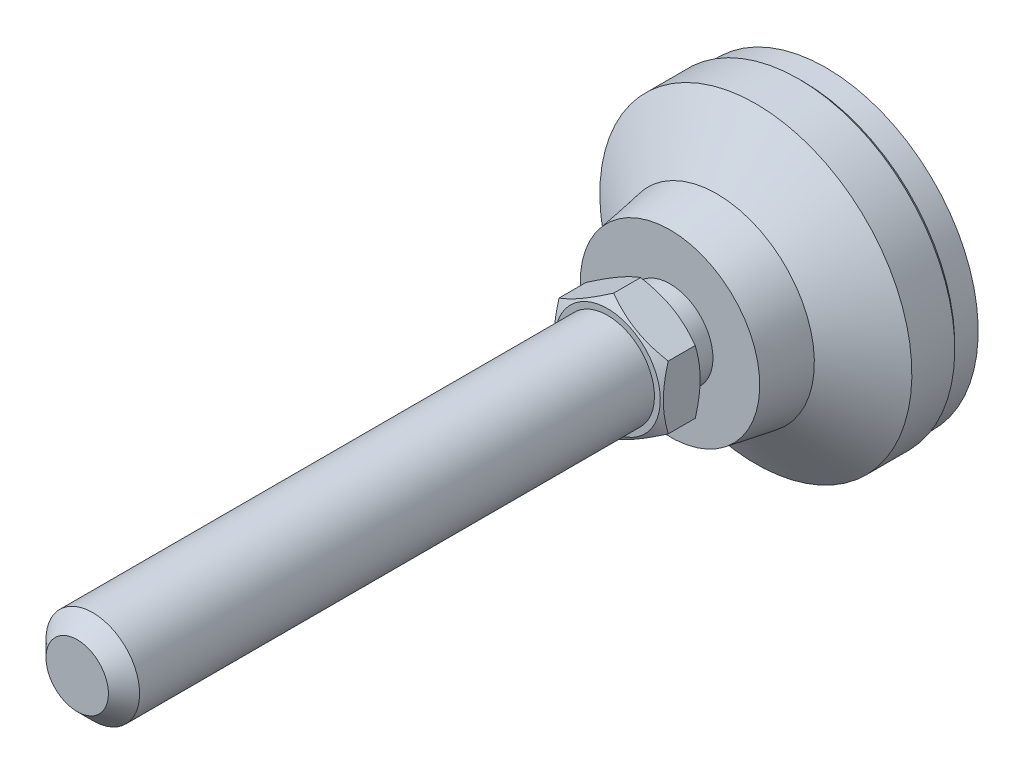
ISO-10303-21;
HEADER;
FILE_DESCRIPTION(('STEP AP214'),'2;1');
FILE_NAME('part.step','',(''),(''),'','','');
FILE_SCHEMA(('AUTOMOTIVE_DESIGN { 1 0 10303 214 1 1 1 1 }'));
ENDSEC;
DATA;
#1=APPLICATION_CONTEXT('core data for automotive mechanical design processes');
#2=APPLICATION_PROTOCOL_DEFINITION('international standard','automotive_design',2000,#1);
#3=PRODUCT_CONTEXT('',#1,'mechanical');
#4=PRODUCT('Part','Part','',(#3));
#5=PRODUCT_RELATED_PRODUCT_CATEGORY('part','',(#4));
#6=PRODUCT_DEFINITION_FORMATION('','',#4);
#7=PRODUCT_DEFINITION_CONTEXT('part definition',#1,'design');
#8=PRODUCT_DEFINITION('design','',#6,#7);
#9=PRODUCT_DEFINITION_SHAPE('','',#8);
#10=(LENGTH_UNIT() NAMED_UNIT(*) SI_UNIT(.MILLI.,.METRE.));
#11=(NAMED_UNIT(*) PLANE_ANGLE_UNIT() SI_UNIT($,.RADIAN.));
#12=(NAMED_UNIT(*) SI_UNIT($,.STERADIAN.) SOLID_ANGLE_UNIT());
#13=UNCERTAINTY_MEASURE_WITH_UNIT(LENGTH_MEASURE(1.E-05),#10,'distance_accuracy_value','');
#14=(GEOMETRIC_REPRESENTATION_CONTEXT(3) GLOBAL_UNCERTAINTY_ASSIGNED_CONTEXT((#13)) GLOBAL_UNIT_ASSIGNED_CONTEXT((#10,
#11,#12)) REPRESENTATION_CONTEXT('',''));
#15=CARTESIAN_POINT('',(0.,0.,0.));
#16=DIRECTION('',(0.,0.,1.));
#17=DIRECTION('',(1.,0.,0.));
#18=AXIS2_PLACEMENT_3D('',#15,#16,#17);
#19=CARTESIAN_POINT('',(0.,0.,1.99999999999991));
#20=DIRECTION('',(0.,0.,-1.));
#21=DIRECTION('',(0.,1.,0.));
#22=AXIS2_PLACEMENT_3D('',#19,#20,#21);
#23=CYLINDRICAL_SURFACE('',#22,20.);
#24=CARTESIAN_POINT('',(0.,0.,3.5));
#25=DIRECTION('',(0.,0.,-1.));
#26=DIRECTION('',(0.,1.,0.));
#27=AXIS2_PLACEMENT_3D('',#24,#25,#26);
#28=CIRCLE('',#27,20.);
#29=CARTESIAN_POINT('',(0.,20.,3.5));
#30=VERTEX_POINT('',#29);
#31=EDGE_CURVE('E114',#30,#30,#28,.F.);
#32=ORIENTED_EDGE('',*,*,#31,.T.);
#33=EDGE_LOOP('',(#32));
#34=FACE_BOUND('',#33,.T.);
#35=CARTESIAN_POINT('',(0.,0.,9.));
#36=DIRECTION('',(0.,0.,-1.));
#37=DIRECTION('',(0.,1.,0.));
#38=AXIS2_PLACEMENT_3D('',#35,#36,#37);
#39=CIRCLE('',#38,20.);
#40=CARTESIAN_POINT('',(0.,20.,9.));
#41=VERTEX_POINT('',#40);
#42=EDGE_CURVE('E108',#41,#41,#39,.T.);
#43=ORIENTED_EDGE('',*,*,#42,.T.);
#44=EDGE_LOOP('',(#43));
#45=FACE_BOUND('',#44,.T.);
#46=ADVANCED_FACE('F14',(#34,#45),#23,.T.);
#47=CARTESIAN_POINT('',(0.,0.,14.));
#48=DIRECTION('',(0.,0.,-1.));
#49=DIRECTION('',(0.,1.,0.));
#50=AXIS2_PLACEMENT_3D('',#47,#48,#49);
#51=CONICAL_SURFACE('',#50,12.5,0.98279372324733);
#52=ORIENTED_EDGE('',*,*,#42,.F.);
#53=EDGE_LOOP('',(#52));
#54=FACE_BOUND('',#53,.T.);
#55=CARTESIAN_POINT('',(0.,0.,14.));
#56=DIRECTION('',(0.,0.,-1.));
#57=DIRECTION('',(0.,1.,0.));
#58=AXIS2_PLACEMENT_3D('',#55,#56,#57);
#59=CIRCLE('',#58,12.5);
#60=CARTESIAN_POINT('',(0.,12.5,14.));
#61=VERTEX_POINT('',#60);
#62=EDGE_CURVE('E105',#61,#61,#59,.T.);
#63=ORIENTED_EDGE('',*,*,#62,.T.);
#64=EDGE_LOOP('',(#63));
#65=FACE_BOUND('',#64,.T.);
#66=ADVANCED_FACE('F226',(#54,#65),#51,.T.);
#67=CARTESIAN_POINT('',(0.,0.,20.));
#68=DIRECTION('',(0.,0.,-1.));
#69=DIRECTION('',(0.,1.,0.));
#70=AXIS2_PLACEMENT_3D('',#67,#68,#69);
#71=CONICAL_SURFACE('',#70,11.5,0.165148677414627);
#72=ORIENTED_EDGE('',*,*,#62,.F.);
#73=EDGE_LOOP('',(#72));
#74=FACE_BOUND('',#73,.T.);
#75=CARTESIAN_POINT('',(0.,0.,20.));
#76=DIRECTION('',(0.,0.,-1.));
#77=DIRECTION('',(0.,1.,0.));
#78=AXIS2_PLACEMENT_3D('',#75,#76,#77);
#79=CIRCLE('',#78,11.5);
#80=CARTESIAN_POINT('',(0.,11.5,20.));
#81=VERTEX_POINT('',#80);
#82=EDGE_CURVE('E102',#81,#81,#79,.T.);
#83=ORIENTED_EDGE('',*,*,#82,.T.);
#84=EDGE_LOOP('',(#83));
#85=FACE_BOUND('',#84,.T.);
#86=ADVANCED_FACE('F222',(#74,#85),#71,.T.);
#87=CARTESIAN_POINT('',(-11.5,0.,20.));
#88=DIRECTION('',(0.,0.,-1.));
#89=DIRECTION('',(0.,1.,0.));
#90=AXIS2_PLACEMENT_3D('',#87,#88,#89);
#91=PLANE('',#90);
#92=ORIENTED_EDGE('',*,*,#82,.F.);
#93=EDGE_LOOP('',(#92));
#94=FACE_BOUND('',#93,.T.);
#95=CARTESIAN_POINT('',(0.,0.,20.));
#96=DIRECTION('',(0.,0.,-1.));
#97=DIRECTION('',(0.,1.,0.));
#98=AXIS2_PLACEMENT_3D('',#95,#96,#97);
#99=CIRCLE('',#98,5.49999999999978);
#100=CARTESIAN_POINT('',(0.,5.49999999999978,20.));
#101=VERTEX_POINT('',#100);
#102=EDGE_CURVE('E99',#101,#101,#99,.T.);
#103=ORIENTED_EDGE('',*,*,#102,.T.);
#104=EDGE_LOOP('',(#103));
#105=FACE_BOUND('',#104,.T.);
#106=ADVANCED_FACE('F218',(#94,#105),#91,.F.);
#107=CARTESIAN_POINT('',(0.,0.,1.99999999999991));
#108=DIRECTION('',(0.,0.,-1.));
#109=DIRECTION('',(0.,1.,0.));
#110=AXIS2_PLACEMENT_3D('',#107,#108,#109);
#111=CYLINDRICAL_SURFACE('',#110,5.49999999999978);
#112=ORIENTED_EDGE('',*,*,#102,.F.);
#113=EDGE_LOOP('',(#112));
#114=FACE_BOUND('',#113,.T.);
#115=CARTESIAN_POINT('',(0.,0.,23.));
#116=DIRECTION('',(0.,0.,-1.));
#117=DIRECTION('',(0.,1.,0.));
#118=AXIS2_PLACEMENT_3D('',#115,#116,#117);
#119=CIRCLE('',#118,5.49999999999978);
#120=CARTESIAN_POINT('',(0.,5.49999999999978,23.));
#121=VERTEX_POINT('',#120);
#122=EDGE_CURVE('E96',#121,#121,#119,.T.);
#123=ORIENTED_EDGE('',*,*,#122,.T.);
#124=EDGE_LOOP('',(#123));
#125=FACE_BOUND('',#124,.T.);
#126=ADVANCED_FACE('F214',(#114,#125),#111,.T.);
#127=CARTESIAN_POINT('',(-5.49999999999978,0.,23.));
#128=DIRECTION('',(0.,0.,1.));
#129=DIRECTION('',(0.,-1.,0.));
#130=AXIS2_PLACEMENT_3D('',#127,#128,#129);
#131=PLANE('',#130);
#132=CARTESIAN_POINT('',(0.,0.,23.));
#133=DIRECTION('',(0.,0.,1.));
#134=DIRECTION('',(0.,-1.,0.));
#135=AXIS2_PLACEMENT_3D('',#132,#133,#134);
#136=CIRCLE('',#135,6.75);
#137=CARTESIAN_POINT('',(0.,-6.75,23.));
#138=VERTEX_POINT('',#137);
#139=EDGE_CURVE('E305',#138,#138,#136,.T.);
#140=ORIENTED_EDGE('',*,*,#139,.F.);
#141=EDGE_LOOP('',(#140));
#142=FACE_BOUND('',#141,.T.);
#143=ORIENTED_EDGE('',*,*,#122,.F.);
#144=EDGE_LOOP('',(#143));
#145=FACE_BOUND('',#144,.T.);
#146=ADVANCED_FACE('F211',(#142,#145),#131,.F.);
#147=CARTESIAN_POINT('',(0.,0.,3.));
#148=DIRECTION('',(0.,0.,1.));
#149=DIRECTION('',(0.,-1.,0.));
#150=AXIS2_PLACEMENT_3D('',#147,#148,#149);
#151=CONICAL_SURFACE('',#150,19.5,0.785398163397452);
#152=ORIENTED_EDGE('',*,*,#31,.F.);
#153=EDGE_LOOP('',(#152));
#154=FACE_BOUND('',#153,.T.);
#155=CARTESIAN_POINT('',(0.,0.,3.));
#156=DIRECTION('',(0.,0.,-1.));
#157=DIRECTION('',(0.,1.,0.));
#158=AXIS2_PLACEMENT_3D('',#155,#156,#157);
#159=CIRCLE('',#158,19.5);
#160=CARTESIAN_POINT('',(0.,19.5,3.));
#161=VERTEX_POINT('',#160);
#162=EDGE_CURVE('E111',#161,#161,#159,.T.);
#163=ORIENTED_EDGE('',*,*,#162,.F.);
#164=EDGE_LOOP('',(#163));
#165=FACE_BOUND('',#164,.T.);
#166=ADVANCED_FACE('F16',(#154,#165),#151,.T.);
#167=CARTESIAN_POINT('',(0.,0.,0.));
#168=DIRECTION('',(0.,0.,1.));
#169=DIRECTION('',(0.,-1.,0.));
#170=AXIS2_PLACEMENT_3D('',#167,#168,#169);
#171=CYLINDRICAL_SURFACE('',#170,19.5);
#172=CARTESIAN_POINT('',(0.,0.,0.));
#173=DIRECTION('',(0.,0.,-1.));
#174=DIRECTION('',(0.,1.,0.));
#175=AXIS2_PLACEMENT_3D('',#172,#173,#174);
#176=CIRCLE('',#175,19.5);
#177=CARTESIAN_POINT('',(0.,19.5,0.));
#178=VERTEX_POINT('',#177);
#179=EDGE_CURVE('E278',#178,#178,#176,.T.);
#180=ORIENTED_EDGE('',*,*,#179,.F.);
#181=EDGE_LOOP('',(#180));
#182=FACE_BOUND('',#181,.T.);
#183=ORIENTED_EDGE('',*,*,#162,.T.);
#184=EDGE_LOOP('',(#183));
#185=FACE_BOUND('',#184,.T.);
#186=ADVANCED_FACE('F251',(#182,#185),#171,.T.);
#187=CARTESIAN_POINT('',(0.,0.,0.));
#188=DIRECTION('',(0.,0.,-1.));
#189=DIRECTION('',(0.,1.,0.));
#190=AXIS2_PLACEMENT_3D('',#187,#188,#189);
#191=PLANE('',#190);
#192=ORIENTED_EDGE('',*,*,#179,.T.);
#193=EDGE_LOOP('',(#192));
#194=FACE_BOUND('',#193,.T.);
#195=ADVANCED_FACE('F134',(#194),#191,.T.);
#196=CARTESIAN_POINT('',(0.,0.,23.));
#197=DIRECTION('',(0.,0.,1.));
#198=DIRECTION('',(0.,-1.,0.));
#199=AXIS2_PLACEMENT_3D('',#196,#197,#198);
#200=CONICAL_SURFACE('',#199,6.75,1.0471975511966);
#201=CARTESIAN_POINT('',(0.000200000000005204,-8.08301923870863,23.7696190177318));
#202=CARTESIAN_POINT('',(-0.153667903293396,-7.99418356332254,23.7183374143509));
#203=CARTESIAN_POINT('',(-0.308109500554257,-7.90501666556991,23.669383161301));
#204=CARTESIAN_POINT('',(-0.618246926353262,-7.72595873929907,23.5767703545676));
#205=CARTESIAN_POINT('',(-0.773943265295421,-7.63606741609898,23.5331140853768));
#206=CARTESIAN_POINT('',(-1.24352516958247,-7.36495417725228,23.4109491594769));
#207=CARTESIAN_POINT('',(-1.55926433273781,-7.18266208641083,23.3414631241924));
#208=CARTESIAN_POINT('',(-2.03176224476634,-6.90986528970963,23.2599825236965));
#209=CARTESIAN_POINT('',(-2.18710922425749,-6.82017566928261,23.2367710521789));
#210=CARTESIAN_POINT('',(-2.49850511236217,-6.64039116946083,23.1978487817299));
#211=CARTESIAN_POINT('',(-2.65455395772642,-6.55029632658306,23.1821373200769));
#212=CARTESIAN_POINT('',(-2.96692267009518,-6.36995016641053,23.1586154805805));
#213=CARTESIAN_POINT('',(-3.12324202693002,-6.27969914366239,23.1507961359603));
#214=CARTESIAN_POINT('',(-3.43601650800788,-6.09911871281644,23.1432178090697));
#215=CARTESIAN_POINT('',(-3.59247162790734,-6.00878930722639,23.1434585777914));
#216=CARTESIAN_POINT('',(-4.02110687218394,-5.76131663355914,23.1551972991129));
#217=CARTESIAN_POINT('',(-4.2931466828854,-5.60425437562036,23.1749033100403));
#218=CARTESIAN_POINT('',(-4.83541944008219,-5.29117305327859,23.2373910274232));
#219=CARTESIAN_POINT('',(-5.10565047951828,-5.13515508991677,23.2801940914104));
#220=CARTESIAN_POINT('',(-5.64901454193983,-4.82144370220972,23.3871892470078));
#221=CARTESIAN_POINT('',(-5.92207900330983,-4.66378986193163,23.4518346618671));
#222=CARTESIAN_POINT('',(-6.46413578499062,-4.35083323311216,23.5985536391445));
#223=CARTESIAN_POINT('',(-6.73313504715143,-4.19552643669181,23.680592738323));
#224=CARTESIAN_POINT('',(-7.0002,-4.04133641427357,23.7696190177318));
#225=B_SPLINE_CURVE_WITH_KNOTS('',3,(#201,#202,#203,#204,#205,#206,#207,#208,#209,#210,#211,
#212,#213,#214,#215,#216,#217,#218,#219,#220,#221,#222,#223,#224),.UNSPECIFIED.,.F.,.F.,(4,2,2,
2,2,2,2,2,2,2,2,4),(0.,0.554727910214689,1.10969417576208,2.22193274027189,2.76443041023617,
3.30688013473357,3.84871284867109,4.39052882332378,5.33376515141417,6.27787517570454,
7.24292418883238,8.20607866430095),.UNSPECIFIED.);
#226=CARTESIAN_POINT('',(0.,-8.08290376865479,23.7695523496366));
#227=VERTEX_POINT('',#226);
#228=CARTESIAN_POINT('',(-7.,-4.04145188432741,23.7695523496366));
#229=VERTEX_POINT('',#228);
#230=EDGE_CURVE('E73',#227,#229,#225,.T.);
#231=ORIENTED_EDGE('',*,*,#230,.T.);
#232=CARTESIAN_POINT('',(-7.,10.7756723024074,26.5216707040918));
#233=CARTESIAN_POINT('',(-7.,10.470597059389,26.3740060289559));
#234=CARTESIAN_POINT('',(-7.,10.1648128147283,26.2277806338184));
#235=CARTESIAN_POINT('',(-7.,9.55144894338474,25.939019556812));
#236=CARTESIAN_POINT('',(-7.,9.24386903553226,25.7964844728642));
#237=CARTESIAN_POINT('',(-7.,8.62491290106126,25.5151808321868));
#238=CARTESIAN_POINT('',(-7.,8.31352506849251,25.3764377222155));
#239=CARTESIAN_POINT('',(-7.,7.68824450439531,25.1047376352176));
#240=CARTESIAN_POINT('',(-7.,7.3743518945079,24.9717803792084));
#241=CARTESIAN_POINT('',(-7.,6.73374949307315,24.7091594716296));
#242=CARTESIAN_POINT('',(-7.,6.40694455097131,24.5797266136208));
#243=CARTESIAN_POINT('',(-7.,5.74948257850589,24.3308524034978));
#244=CARTESIAN_POINT('',(-7.,5.41882511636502,24.2114121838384));
#245=CARTESIAN_POINT('',(-7.,4.75377330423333,23.9857180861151));
#246=CARTESIAN_POINT('',(-7.,4.41938835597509,23.8794368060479));
#247=CARTESIAN_POINT('',(-7.,3.74583525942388,23.6835221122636));
#248=CARTESIAN_POINT('',(-7.,3.40666867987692,23.5938833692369));
#249=CARTESIAN_POINT('',(-7.,2.72516710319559,23.4360858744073));
#250=CARTESIAN_POINT('',(-7.,2.38285906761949,23.3678138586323));
#251=CARTESIAN_POINT('',(-7.,1.86634504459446,23.2844268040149));
#252=CARTESIAN_POINT('',(-7.,1.69365173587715,23.2598001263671));
#253=CARTESIAN_POINT('',(-7.,1.34743429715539,23.2173718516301));
#254=CARTESIAN_POINT('',(-7.,1.17391024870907,23.1995695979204));
#255=CARTESIAN_POINT('',(-7.,0.828495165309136,23.1713639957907));
#256=CARTESIAN_POINT('',(-7.,0.656611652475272,23.1608688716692));
#257=CARTESIAN_POINT('',(-7.,0.312555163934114,23.1471508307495));
#258=CARTESIAN_POINT('',(-7.,0.140382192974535,23.1439277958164));
#259=CARTESIAN_POINT('',(-7.,-0.203946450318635,23.1448306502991));
#260=CARTESIAN_POINT('',(-7.,-0.376102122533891,23.1489565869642));
#261=CARTESIAN_POINT('',(-7.,-0.720089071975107,23.1644579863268));
#262=CARTESIAN_POINT('',(-7.,-0.891920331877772,23.1758338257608));
#263=CARTESIAN_POINT('',(-7.,-1.30734464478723,23.2118624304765));
#264=CARTESIAN_POINT('',(-7.,-1.55063381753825,23.2400915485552));
#265=CARTESIAN_POINT('',(-7.,-2.03534189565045,23.3095242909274));
#266=CARTESIAN_POINT('',(-7.,-2.27676053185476,23.3507297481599));
#267=CARTESIAN_POINT('',(-7.,-2.99797093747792,23.4916200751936));
#268=CARTESIAN_POINT('',(-7.,-3.47443457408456,23.6085512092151));
#269=CARTESIAN_POINT('',(-7.,-4.18677226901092,23.8105038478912));
#270=CARTESIAN_POINT('',(-7.,-4.42636136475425,23.883168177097));
#271=CARTESIAN_POINT('',(-7.,-4.90321122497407,24.0358402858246));
#272=CARTESIAN_POINT('',(-7.,-5.14047197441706,24.1158481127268));
#273=CARTESIAN_POINT('',(-7.,-5.61274376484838,24.281940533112));
#274=CARTESIAN_POINT('',(-7.,-5.84775556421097,24.3680229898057));
#275=CARTESIAN_POINT('',(-7.,-6.31584583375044,24.5452721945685));
#276=CARTESIAN_POINT('',(-7.,-6.54892432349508,24.6364388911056));
#277=CARTESIAN_POINT('',(-7.,-7.0859805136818,24.8521790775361));
#278=CARTESIAN_POINT('',(-7.,-7.38934113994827,24.9782855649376));
#279=CARTESIAN_POINT('',(-7.,-7.99359303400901,25.2362973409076));
#280=CARTESIAN_POINT('',(-7.,-8.29448417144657,25.3682029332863));
#281=CARTESIAN_POINT('',(-7.,-8.89424068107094,25.6366863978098));
#282=CARTESIAN_POINT('',(-7.,-9.19310564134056,25.7732651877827));
#283=CARTESIAN_POINT('',(-7.,-9.78907845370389,26.0501823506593));
#284=CARTESIAN_POINT('',(-7.,-10.0861863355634,26.1905206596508));
#285=CARTESIAN_POINT('',(-7.,-10.6792023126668,26.4744042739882));
#286=CARTESIAN_POINT('',(-7.,-10.9751090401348,26.6179524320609));
#287=CARTESIAN_POINT('',(-7.,-11.5656733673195,26.9075977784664));
#288=CARTESIAN_POINT('',(-7.,-11.8603309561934,27.0536949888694));
#289=CARTESIAN_POINT('',(-7.,-12.7427336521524,27.4951566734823));
#290=CARTESIAN_POINT('',(-7.,-13.3288964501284,27.7936852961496));
#291=CARTESIAN_POINT('',(-7.,-14.1823685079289,28.2338804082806));
#292=CARTESIAN_POINT('',(-7.,-14.4509033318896,28.3731855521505));
#293=CARTESIAN_POINT('',(-7.,-14.9873899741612,28.652903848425));
#294=CARTESIAN_POINT('',(-7.,-15.2553418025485,28.7933169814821));
#295=CARTESIAN_POINT('',(-7.,-16.0584600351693,29.2160063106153));
#296=CARTESIAN_POINT('',(-7.,-16.5928687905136,29.4997218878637));
#297=CARTESIAN_POINT('',(-7.,-17.6588858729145,30.0694348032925));
#298=CARTESIAN_POINT('',(-7.,-18.1904978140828,30.355425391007));
#299=CARTESIAN_POINT('',(-7.,-19.2524337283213,30.9297243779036));
#300=CARTESIAN_POINT('',(-7.,-19.782757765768,31.218032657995));
#301=CARTESIAN_POINT('',(-7.,-20.3126038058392,31.5072111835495));
#302=B_SPLINE_CURVE_WITH_KNOTS('',3,(#232,#233,#234,#235,#236,#237,#238,#239,#240,#241,#242,
#243,#244,#245,#246,#247,#248,#249,#250,#251,#252,#253,#254,#255,#256,#257,#258,#259,#260,#261,
#262,#263,#264,#265,#266,#267,#268,#269,#270,#271,#272,#273,#274,#275,#276,#277,#278,#279,#280,
#281,#282,#283,#284,#285,#286,#287,#288,#289,#290,#291,#292,#293,#294,#295,#296,#297,#298,#299,
#300,#301),.UNSPECIFIED.,.F.,.F.,(4,2,2,2,2,2,2,2,2,2,2,2,2,2,2,2,2,2,2,2,2,2,2,2,2,2,2,2,2,2,2,
2,2,2,4),(0.,1.01681261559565,2.03378896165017,3.05643842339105,4.07903852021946,
5.1334206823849,6.18792217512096,7.24018947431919,8.29211923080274,9.33837441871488,
9.86158193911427,10.3847391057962,10.9012008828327,11.417654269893,11.9341109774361,
12.4505945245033,13.1849421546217,13.9193935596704,15.3891445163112,16.1401820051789,
16.8912243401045,17.6420037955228,18.3927756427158,19.3782791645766,20.3638343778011,
21.3495842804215,22.3353174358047,23.3219645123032,24.3086201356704,26.2819721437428,
27.1895239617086,28.0970599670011,29.91220086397,31.7231661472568,33.5340389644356),.UNSPECIFIED.);
#303=CARTESIAN_POINT('',(-7.,4.04145188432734,23.7695523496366));
#304=VERTEX_POINT('',#303);
#305=EDGE_CURVE('E81',#229,#304,#302,.F.);
#306=ORIENTED_EDGE('',*,*,#305,.T.);
#307=CARTESIAN_POINT('',(-7.0002,4.0413364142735,23.7696190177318));
#308=CARTESIAN_POINT('',(-6.8463320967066,4.13017208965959,23.7183374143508));
#309=CARTESIAN_POINT('',(-6.69189049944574,4.21933898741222,23.669383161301));
#310=CARTESIAN_POINT('',(-6.38175307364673,4.39839691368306,23.5767703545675));
#311=CARTESIAN_POINT('',(-6.22605673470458,4.48828823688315,23.5331140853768));
#312=CARTESIAN_POINT('',(-5.75647483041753,4.75940147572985,23.4109491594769));
#313=CARTESIAN_POINT('',(-5.4407356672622,4.94169356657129,23.3414631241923));
#314=CARTESIAN_POINT('',(-4.96823775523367,5.2144903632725,23.2599825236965));
#315=CARTESIAN_POINT('',(-4.81289077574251,5.30417998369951,23.2367710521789));
#316=CARTESIAN_POINT('',(-4.50149488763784,5.48396448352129,23.1978487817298));
#317=CARTESIAN_POINT('',(-4.34544604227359,5.57405932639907,23.1821373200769));
#318=CARTESIAN_POINT('',(-4.03307732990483,5.75440548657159,23.1586154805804));
#319=CARTESIAN_POINT('',(-3.87675797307,5.84465650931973,23.1507961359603));
#320=CARTESIAN_POINT('',(-3.56398349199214,6.02523694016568,23.1432178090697));
#321=CARTESIAN_POINT('',(-3.40752837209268,6.11556634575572,23.1434585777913));
#322=CARTESIAN_POINT('',(-2.97889312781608,6.36303901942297,23.1551972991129));
#323=CARTESIAN_POINT('',(-2.70685331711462,6.52010127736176,23.1749033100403));
#324=CARTESIAN_POINT('',(-2.16458055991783,6.83318259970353,23.2373910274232));
#325=CARTESIAN_POINT('',(-1.89434952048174,6.98920056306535,23.2801940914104));
#326=CARTESIAN_POINT('',(-1.35098545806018,7.3029119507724,23.3871892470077));
#327=CARTESIAN_POINT('',(-1.07792099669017,7.4605657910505,23.4518346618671));
#328=CARTESIAN_POINT('',(-0.535864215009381,7.77352241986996,23.5985536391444));
#329=CARTESIAN_POINT('',(-0.266864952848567,7.92882921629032,23.6805927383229));
#330=CARTESIAN_POINT('',(0.000200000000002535,8.08301923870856,23.7696190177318));
#331=B_SPLINE_CURVE_WITH_KNOTS('',3,(#307,#308,#309,#310,#311,#312,#313,#314,#315,#316,#317,
#318,#319,#320,#321,#322,#323,#324,#325,#326,#327,#328,#329,#330),.UNSPECIFIED.,.F.,.F.,(4,2,2,
2,2,2,2,2,2,2,2,4),(0.,0.554727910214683,1.10969417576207,2.22193274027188,2.76443041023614,
3.30688013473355,3.84871284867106,4.39052882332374,5.33376515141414,6.27787517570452,
7.24292418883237,8.20607866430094),.UNSPECIFIED.);
#332=CARTESIAN_POINT('',(0.,8.08290376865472,23.7695523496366));
#333=VERTEX_POINT('',#332);
#334=EDGE_CURVE('E193',#304,#333,#331,.T.);
#335=ORIENTED_EDGE('',*,*,#334,.T.);
#336=CARTESIAN_POINT('',(-0.000199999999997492,8.08301923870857,23.7696190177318));
#337=CARTESIAN_POINT('',(0.153667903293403,7.99418356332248,23.7183374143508));
#338=CARTESIAN_POINT('',(0.308109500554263,7.90501666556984,23.669383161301));
#339=CARTESIAN_POINT('',(0.618246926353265,7.72595873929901,23.5767703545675));
#340=CARTESIAN_POINT('',(0.773943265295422,7.63606741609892,23.5331140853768));
#341=CARTESIAN_POINT('',(1.24352516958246,7.36495417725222,23.4109491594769));
#342=CARTESIAN_POINT('',(1.5592643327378,7.18266208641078,23.3414631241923));
#343=CARTESIAN_POINT('',(2.03176224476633,6.90986528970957,23.2599825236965));
#344=CARTESIAN_POINT('',(2.18710922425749,6.82017566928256,23.2367710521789));
#345=CARTESIAN_POINT('',(2.49850511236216,6.64039116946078,23.1978487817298));
#346=CARTESIAN_POINT('',(2.65455395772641,6.550296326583,23.1821373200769));
#347=CARTESIAN_POINT('',(2.96692267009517,6.36995016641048,23.1586154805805));
#348=CARTESIAN_POINT('',(3.12324202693,6.27969914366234,23.1507961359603));
#349=CARTESIAN_POINT('',(3.43601650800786,6.09911871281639,23.1432178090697));
#350=CARTESIAN_POINT('',(3.59247162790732,6.00878930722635,23.1434585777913));
#351=CARTESIAN_POINT('',(4.02110687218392,5.7613166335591,23.1551972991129));
#352=CARTESIAN_POINT('',(4.29314668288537,5.60425437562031,23.1749033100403));
#353=CARTESIAN_POINT('',(4.83541944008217,5.29117305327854,23.2373910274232));
#354=CARTESIAN_POINT('',(5.10565047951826,5.13515508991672,23.2801940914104));
#355=CARTESIAN_POINT('',(5.64901454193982,4.82144370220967,23.3871892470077));
#356=CARTESIAN_POINT('',(5.92207900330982,4.66378986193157,23.4518346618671));
#357=CARTESIAN_POINT('',(6.46413578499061,4.35083323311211,23.5985536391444));
#358=CARTESIAN_POINT('',(6.73313504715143,4.19552643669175,23.6805927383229));
#359=CARTESIAN_POINT('',(7.0002,4.04133641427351,23.7696190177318));
#360=B_SPLINE_CURVE_WITH_KNOTS('',3,(#336,#337,#338,#339,#340,#341,#342,#343,#344,#345,#346,
#347,#348,#349,#350,#351,#352,#353,#354,#355,#356,#357,#358,#359),.UNSPECIFIED.,.F.,.F.,(4,2,2,
2,2,2,2,2,2,2,2,4),(0.,0.554727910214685,1.10969417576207,2.22193274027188,2.76443041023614,
3.30688013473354,3.84871284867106,4.39052882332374,5.33376515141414,6.27787517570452,
7.24292418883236,8.20607866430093),.UNSPECIFIED.);
#361=CARTESIAN_POINT('',(7.,4.04145188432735,23.7695523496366));
#362=VERTEX_POINT('',#361);
#363=EDGE_CURVE('E304',#333,#362,#360,.T.);
#364=ORIENTED_EDGE('',*,*,#363,.T.);
#365=CARTESIAN_POINT('',(7.,10.7756723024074,26.5216707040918));
#366=CARTESIAN_POINT('',(7.,10.470597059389,26.3740060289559));
#367=CARTESIAN_POINT('',(7.,10.1648128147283,26.2277806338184));
#368=CARTESIAN_POINT('',(7.,9.55144894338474,25.939019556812));
#369=CARTESIAN_POINT('',(7.,9.24386903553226,25.7964844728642));
#370=CARTESIAN_POINT('',(7.,8.62491290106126,25.5151808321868));
#371=CARTESIAN_POINT('',(7.,8.31352506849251,25.3764377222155));
#372=CARTESIAN_POINT('',(7.,7.68824450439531,25.1047376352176));
#373=CARTESIAN_POINT('',(7.,7.3743518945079,24.9717803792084));
#374=CARTESIAN_POINT('',(7.,6.73374949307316,24.7091594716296));
#375=CARTESIAN_POINT('',(7.,6.40694455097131,24.5797266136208));
#376=CARTESIAN_POINT('',(7.,5.7494825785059,24.3308524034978));
#377=CARTESIAN_POINT('',(7.,5.41882511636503,24.2114121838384));
#378=CARTESIAN_POINT('',(7.,4.75377330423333,23.9857180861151));
#379=CARTESIAN_POINT('',(7.,4.41938835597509,23.8794368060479));
#380=CARTESIAN_POINT('',(7.,3.74583525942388,23.6835221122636));
#381=CARTESIAN_POINT('',(7.,3.40666867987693,23.5938833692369));
#382=CARTESIAN_POINT('',(7.,2.7251671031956,23.4360858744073));
#383=CARTESIAN_POINT('',(7.,2.3828590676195,23.3678138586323));
#384=CARTESIAN_POINT('',(7.,1.86634504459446,23.2844268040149));
#385=CARTESIAN_POINT('',(7.,1.69365173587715,23.2598001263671));
#386=CARTESIAN_POINT('',(7.,1.3474342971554,23.2173718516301));
#387=CARTESIAN_POINT('',(7.,1.17391024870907,23.1995695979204));
#388=CARTESIAN_POINT('',(7.,0.828495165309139,23.1713639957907));
#389=CARTESIAN_POINT('',(7.,0.656611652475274,23.1608688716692));
#390=CARTESIAN_POINT('',(7.,0.312555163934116,23.1471508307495));
#391=CARTESIAN_POINT('',(7.,0.140382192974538,23.1439277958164));
#392=CARTESIAN_POINT('',(7.,-0.203946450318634,23.1448306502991));
#393=CARTESIAN_POINT('',(7.,-0.37610212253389,23.1489565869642));
#394=CARTESIAN_POINT('',(7.,-0.720089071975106,23.1644579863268));
#395=CARTESIAN_POINT('',(7.,-0.891920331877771,23.1758338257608));
#396=CARTESIAN_POINT('',(7.,-1.30734464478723,23.2118624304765));
#397=CARTESIAN_POINT('',(7.,-1.55063381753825,23.2400915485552));
#398=CARTESIAN_POINT('',(7.,-2.03534189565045,23.3095242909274));
#399=CARTESIAN_POINT('',(7.,-2.27676053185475,23.3507297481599));
#400=CARTESIAN_POINT('',(7.,-2.99797093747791,23.4916200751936));
#401=CARTESIAN_POINT('',(7.,-3.47443457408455,23.6085512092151));
#402=CARTESIAN_POINT('',(7.,-4.18677226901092,23.8105038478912));
#403=CARTESIAN_POINT('',(7.,-4.42636136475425,23.883168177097));
#404=CARTESIAN_POINT('',(7.,-4.90321122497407,24.0358402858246));
#405=CARTESIAN_POINT('',(7.,-5.14047197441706,24.1158481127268));
#406=CARTESIAN_POINT('',(7.,-5.61274376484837,24.281940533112));
#407=CARTESIAN_POINT('',(7.,-5.84775556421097,24.3680229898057));
#408=CARTESIAN_POINT('',(7.,-6.31584583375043,24.5452721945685));
#409=CARTESIAN_POINT('',(7.,-6.54892432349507,24.6364388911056));
#410=CARTESIAN_POINT('',(7.,-7.08598051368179,24.8521790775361));
#411=CARTESIAN_POINT('',(7.,-7.38934113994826,24.9782855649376));
#412=CARTESIAN_POINT('',(7.,-7.993593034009,25.2362973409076));
#413=CARTESIAN_POINT('',(7.,-8.29448417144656,25.3682029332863));
#414=CARTESIAN_POINT('',(7.,-8.89424068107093,25.6366863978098));
#415=CARTESIAN_POINT('',(7.,-9.19310564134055,25.7732651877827));
#416=CARTESIAN_POINT('',(7.,-9.78907845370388,26.0501823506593));
#417=CARTESIAN_POINT('',(7.,-10.0861863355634,26.1905206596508));
#418=CARTESIAN_POINT('',(7.,-10.6792023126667,26.4744042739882));
#419=CARTESIAN_POINT('',(7.,-10.9751090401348,26.6179524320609));
#420=CARTESIAN_POINT('',(7.,-11.5656733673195,26.9075977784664));
#421=CARTESIAN_POINT('',(7.,-11.8603309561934,27.0536949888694));
#422=CARTESIAN_POINT('',(7.,-12.7427336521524,27.4951566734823));
#423=CARTESIAN_POINT('',(7.,-13.3288964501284,27.7936852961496));
#424=CARTESIAN_POINT('',(7.,-14.1823685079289,28.2338804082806));
#425=CARTESIAN_POINT('',(7.,-14.4509033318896,28.3731855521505));
#426=CARTESIAN_POINT('',(7.,-14.9873899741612,28.652903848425));
#427=CARTESIAN_POINT('',(7.,-15.2553418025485,28.7933169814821));
#428=CARTESIAN_POINT('',(7.,-16.0584600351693,29.2160063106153));
#429=CARTESIAN_POINT('',(7.,-16.5928687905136,29.4997218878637));
#430=CARTESIAN_POINT('',(7.,-17.6588858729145,30.0694348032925));
#431=CARTESIAN_POINT('',(7.,-18.1904978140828,30.355425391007));
#432=CARTESIAN_POINT('',(7.,-19.2524337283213,30.9297243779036));
#433=CARTESIAN_POINT('',(7.,-19.782757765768,31.218032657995));
#434=CARTESIAN_POINT('',(7.,-20.3126038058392,31.5072111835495));
#435=B_SPLINE_CURVE_WITH_KNOTS('',3,(#365,#366,#367,#368,#369,#370,#371,#372,#373,#374,#375,
#376,#377,#378,#379,#380,#381,#382,#383,#384,#385,#386,#387,#388,#389,#390,#391,#392,#393,#394,
#395,#396,#397,#398,#399,#400,#401,#402,#403,#404,#405,#406,#407,#408,#409,#410,#411,#412,#413,
#414,#415,#416,#417,#418,#419,#420,#421,#422,#423,#424,#425,#426,#427,#428,#429,#430,#431,#432,
#433,#434),.UNSPECIFIED.,.F.,.F.,(4,2,2,2,2,2,2,2,2,2,2,2,2,2,2,2,2,2,2,2,2,2,2,2,2,2,2,2,2,2,2,
2,2,2,4),(0.,1.01681261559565,2.03378896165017,3.05643842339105,4.07903852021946,
5.1334206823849,6.18792217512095,7.24018947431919,8.29211923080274,9.33837441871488,
9.86158193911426,10.3847391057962,10.9012008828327,11.417654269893,11.9341109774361,
12.4505945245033,13.1849421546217,13.9193935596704,15.3891445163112,16.1401820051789,
16.8912243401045,17.6420037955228,18.3927756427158,19.3782791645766,20.363834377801,
21.3495842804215,22.3353174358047,23.3219645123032,24.3086201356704,26.2819721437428,
27.1895239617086,28.0970599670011,29.91220086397,31.7231661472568,33.5340389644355),.UNSPECIFIED.);
#436=CARTESIAN_POINT('',(7.,-4.04145188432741,23.7695523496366));
#437=VERTEX_POINT('',#436);
#438=EDGE_CURVE('E34',#362,#437,#435,.T.);
#439=ORIENTED_EDGE('',*,*,#438,.T.);
#440=CARTESIAN_POINT('',(7.0002,-4.04133641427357,23.7696190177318));
#441=CARTESIAN_POINT('',(6.8463320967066,-4.13017208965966,23.7183374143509));
#442=CARTESIAN_POINT('',(6.69189049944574,-4.2193389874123,23.669383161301));
#443=CARTESIAN_POINT('',(6.38175307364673,-4.39839691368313,23.5767703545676));
#444=CARTESIAN_POINT('',(6.22605673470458,-4.48828823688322,23.5331140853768));
#445=CARTESIAN_POINT('',(5.75647483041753,-4.75940147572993,23.4109491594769));
#446=CARTESIAN_POINT('',(5.44073566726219,-4.94169356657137,23.3414631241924));
#447=CARTESIAN_POINT('',(4.96823775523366,-5.21449036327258,23.2599825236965));
#448=CARTESIAN_POINT('',(4.8128907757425,-5.30417998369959,23.2367710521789));
#449=CARTESIAN_POINT('',(4.50149488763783,-5.48396448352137,23.1978487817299));
#450=CARTESIAN_POINT('',(4.34544604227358,-5.57405932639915,23.1821373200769));
#451=CARTESIAN_POINT('',(4.03307732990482,-5.75440548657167,23.1586154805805));
#452=CARTESIAN_POINT('',(3.87675797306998,-5.84465650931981,23.1507961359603));
#453=CARTESIAN_POINT('',(3.56398349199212,-6.02523694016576,23.1432178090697));
#454=CARTESIAN_POINT('',(3.40752837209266,-6.11556634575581,23.1434585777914));
#455=CARTESIAN_POINT('',(2.97889312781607,-6.36303901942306,23.1551972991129));
#456=CARTESIAN_POINT('',(2.70685331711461,-6.52010127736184,23.1749033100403));
#457=CARTESIAN_POINT('',(2.16458055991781,-6.83318259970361,23.2373910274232));
#458=CARTESIAN_POINT('',(1.89434952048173,-6.98920056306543,23.2801940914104));
#459=CARTESIAN_POINT('',(1.35098545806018,-7.30291195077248,23.3871892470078));
#460=CARTESIAN_POINT('',(1.07792099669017,-7.46056579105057,23.4518346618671));
#461=CARTESIAN_POINT('',(0.535864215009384,-7.77352241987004,23.5985536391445));
#462=CARTESIAN_POINT('',(0.266864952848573,-7.92882921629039,23.680592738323));
#463=CARTESIAN_POINT('',(-0.000199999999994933,-8.08301923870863,23.7696190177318));
#464=B_SPLINE_CURVE_WITH_KNOTS('',3,(#440,#441,#442,#443,#444,#445,#446,#447,#448,#449,#450,
#451,#452,#453,#454,#455,#456,#457,#458,#459,#460,#461,#462,#463),.UNSPECIFIED.,.F.,.F.,(4,2,2,
2,2,2,2,2,2,2,2,4),(0.,0.554727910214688,1.10969417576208,2.22193274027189,2.76443041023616,
3.30688013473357,3.84871284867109,4.39052882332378,5.33376515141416,6.27787517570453,
7.24292418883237,8.20607866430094),.UNSPECIFIED.);
#465=EDGE_CURVE('E9',#437,#227,#464,.T.);
#466=ORIENTED_EDGE('',*,*,#465,.T.);
#467=EDGE_LOOP('',(#231,#306,#335,#364,#439,#466));
#468=FACE_BOUND('',#467,.T.);
#469=ORIENTED_EDGE('',*,*,#139,.T.);
#470=EDGE_LOOP('',(#469));
#471=FACE_BOUND('',#470,.T.);
#472=ADVANCED_FACE('F71',(#468,#471),#200,.T.);
#473=CARTESIAN_POINT('',(0.,0.,96.));
#474=DIRECTION('',(0.,0.,-1.));
#475=DIRECTION('',(0.,1.,0.));
#476=AXIS2_PLACEMENT_3D('',#473,#474,#475);
#477=PLANE('',#476);
#478=CARTESIAN_POINT('',(0.,0.,96.));
#479=DIRECTION('',(0.,0.,-1.));
#480=DIRECTION('',(0.,1.,0.));
#481=AXIS2_PLACEMENT_3D('',#478,#479,#480);
#482=CIRCLE('',#481,4.);
#483=CARTESIAN_POINT('',(0.,4.,96.));
#484=VERTEX_POINT('',#483);
#485=EDGE_CURVE('E87',#484,#484,#482,.T.);
#486=ORIENTED_EDGE('',*,*,#485,.F.);
#487=EDGE_LOOP('',(#486));
#488=FACE_BOUND('',#487,.T.);
#489=ADVANCED_FACE('F183',(#488),#477,.F.);
#490=CARTESIAN_POINT('',(0.,0.,96.));
#491=DIRECTION('',(0.,0.,-1.));
#492=DIRECTION('',(0.,1.,0.));
#493=AXIS2_PLACEMENT_3D('',#490,#491,#492);
#494=CONICAL_SURFACE('',#493,4.,0.785398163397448);
#495=CARTESIAN_POINT('',(0.,0.,94.));
#496=DIRECTION('',(0.,0.,-1.));
#497=DIRECTION('',(0.,1.,0.));
#498=AXIS2_PLACEMENT_3D('',#495,#496,#497);
#499=CIRCLE('',#498,6.);
#500=CARTESIAN_POINT('',(0.,6.,94.));
#501=VERTEX_POINT('',#500);
#502=EDGE_CURVE('E92',#501,#501,#499,.T.);
#503=ORIENTED_EDGE('',*,*,#502,.F.);
#504=EDGE_LOOP('',(#503));
#505=FACE_BOUND('',#504,.T.);
#506=ORIENTED_EDGE('',*,*,#485,.T.);
#507=EDGE_LOOP('',(#506));
#508=FACE_BOUND('',#507,.T.);
#509=ADVANCED_FACE('F264',(#505,#508),#494,.T.);
#510=CARTESIAN_POINT('',(0.,0.,-4.74975615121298));
#511=DIRECTION('',(0.,0.,-1.));
#512=DIRECTION('',(0.,1.,0.));
#513=AXIS2_PLACEMENT_3D('',#510,#511,#512);
#514=CYLINDRICAL_SURFACE('',#513,6.);
#515=CARTESIAN_POINT('',(0.,0.,28.));
#516=DIRECTION('',(0.,0.,-1.));
#517=DIRECTION('',(0.,1.,0.));
#518=AXIS2_PLACEMENT_3D('',#515,#516,#517);
#519=CIRCLE('',#518,6.);
#520=CARTESIAN_POINT('',(0.,6.,28.));
#521=VERTEX_POINT('',#520);
#522=EDGE_CURVE('E117',#521,#521,#519,.F.);
#523=ORIENTED_EDGE('',*,*,#522,.T.);
#524=EDGE_LOOP('',(#523));
#525=FACE_BOUND('',#524,.T.);
#526=ORIENTED_EDGE('',*,*,#502,.T.);
#527=EDGE_LOOP('',(#526));
#528=FACE_BOUND('',#527,.T.);
#529=ADVANCED_FACE('F209',(#525,#528),#514,.T.);
#530=CARTESIAN_POINT('',(-3.99999999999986,0.,28.));
#531=DIRECTION('',(0.,0.,-1.));
#532=DIRECTION('',(0.,1.,0.));
#533=AXIS2_PLACEMENT_3D('',#530,#531,#532);
#534=PLANE('',#533);
#535=CARTESIAN_POINT('',(0.,0.,28.));
#536=DIRECTION('',(0.,0.,1.));
#537=DIRECTION('',(0.,-1.,0.));
#538=AXIS2_PLACEMENT_3D('',#535,#536,#537);
#539=CIRCLE('',#538,6.75);
#540=CARTESIAN_POINT('',(0.,-6.75,28.));
#541=VERTEX_POINT('',#540);
#542=EDGE_CURVE('E80',#541,#541,#539,.T.);
#543=ORIENTED_EDGE('',*,*,#542,.T.);
#544=EDGE_LOOP('',(#543));
#545=FACE_BOUND('',#544,.T.);
#546=ORIENTED_EDGE('',*,*,#522,.F.);
#547=EDGE_LOOP('',(#546));
#548=FACE_BOUND('',#547,.T.);
#549=ADVANCED_FACE('F131',(#545,#548),#534,.F.);
#550=CARTESIAN_POINT('',(0.,0.,26.6748605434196));
#551=DIRECTION('',(0.,0.,-1.));
#552=DIRECTION('',(0.,1.,0.));
#553=AXIS2_PLACEMENT_3D('',#550,#551,#552);
#554=CONICAL_SURFACE('',#553,9.04520886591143,1.0471975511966);
#555=CARTESIAN_POINT('',(-7.0002,-4.04133641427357,27.230380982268));
#556=CARTESIAN_POINT('',(-6.84633209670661,-4.13017208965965,27.281662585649));
#557=CARTESIAN_POINT('',(-6.69189049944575,-4.21933898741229,27.3306168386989));
#558=CARTESIAN_POINT('',(-6.38175307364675,-4.39839691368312,27.4232296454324));
#559=CARTESIAN_POINT('',(-6.22605673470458,-4.48828823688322,27.4668859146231));
#560=CARTESIAN_POINT('',(-5.75647483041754,-4.75940147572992,27.589050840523));
#561=CARTESIAN_POINT('',(-5.4407356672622,-4.94169356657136,27.6585368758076));
#562=CARTESIAN_POINT('',(-4.96823775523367,-5.21449036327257,27.7400174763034));
#563=CARTESIAN_POINT('',(-4.81289077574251,-5.30417998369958,27.763228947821));
#564=CARTESIAN_POINT('',(-4.50149488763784,-5.48396448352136,27.80215121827));
#565=CARTESIAN_POINT('',(-4.34544604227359,-5.57405932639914,27.817862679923));
#566=CARTESIAN_POINT('',(-4.03307732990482,-5.75440548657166,27.8413845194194));
#567=CARTESIAN_POINT('',(-3.87675797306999,-5.8446565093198,27.8492038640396));
#568=CARTESIAN_POINT('',(-3.56398349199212,-6.02523694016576,27.8567821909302));
#569=CARTESIAN_POINT('',(-3.40752837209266,-6.11556634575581,27.8565414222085));
#570=CARTESIAN_POINT('',(-2.97889312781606,-6.36303901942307,27.8448027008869));
#571=CARTESIAN_POINT('',(-2.7068533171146,-6.52010127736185,27.8250966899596));
#572=CARTESIAN_POINT('',(-2.1645805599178,-6.83318259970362,27.7626089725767));
#573=CARTESIAN_POINT('',(-1.89434952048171,-6.98920056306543,27.7198059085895));
#574=CARTESIAN_POINT('',(-1.35098545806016,-7.30291195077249,27.6128107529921));
#575=CARTESIAN_POINT('',(-1.07792099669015,-7.46056579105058,27.5481653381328));
#576=CARTESIAN_POINT('',(-0.535864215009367,-7.77352241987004,27.4014463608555));
#577=CARTESIAN_POINT('',(-0.266864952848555,-7.9288292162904,27.3194072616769));
#578=CARTESIAN_POINT('',(0.000200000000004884,-8.08301923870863,27.230380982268));
#579=B_SPLINE_CURVE_WITH_KNOTS('',3,(#555,#556,#557,#558,#559,#560,#561,#562,#563,#564,#565,
#566,#567,#568,#569,#570,#571,#572,#573,#574,#575,#576,#577,#578),.UNSPECIFIED.,.F.,.F.,(4,2,2,
2,2,2,2,2,2,2,2,4),(0.,0.554727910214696,1.10969417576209,2.2219327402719,2.76443041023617,
3.30688013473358,3.8487128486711,4.3905288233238,5.33376515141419,6.27787517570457,
7.24292418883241,8.20607866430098),.UNSPECIFIED.);
#580=CARTESIAN_POINT('',(-7.,-4.04145188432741,27.2304476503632));
#581=VERTEX_POINT('',#580);
#582=CARTESIAN_POINT('',(0.,-8.08290376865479,27.2304476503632));
#583=VERTEX_POINT('',#582);
#584=EDGE_CURVE('E171',#581,#583,#579,.T.);
#585=ORIENTED_EDGE('',*,*,#584,.T.);
#586=CARTESIAN_POINT('',(-0.000199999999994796,-8.08301923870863,27.230380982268));
#587=CARTESIAN_POINT('',(0.153667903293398,-7.99418356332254,27.281662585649));
#588=CARTESIAN_POINT('',(0.308109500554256,-7.90501666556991,27.3306168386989));
#589=CARTESIAN_POINT('',(0.618246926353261,-7.72595873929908,27.4232296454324));
#590=CARTESIAN_POINT('',(0.773943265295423,-7.63606741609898,27.4668859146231));
#591=CARTESIAN_POINT('',(1.24352516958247,-7.36495417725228,27.589050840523));
#592=CARTESIAN_POINT('',(1.55926433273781,-7.18266208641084,27.6585368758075));
#593=CARTESIAN_POINT('',(2.03176224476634,-6.90986528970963,27.7400174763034));
#594=CARTESIAN_POINT('',(2.18710922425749,-6.82017566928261,27.763228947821));
#595=CARTESIAN_POINT('',(2.49850511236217,-6.64039116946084,27.80215121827));
#596=CARTESIAN_POINT('',(2.65455395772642,-6.55029632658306,27.817862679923));
#597=CARTESIAN_POINT('',(2.96692267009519,-6.36995016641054,27.8413845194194));
#598=CARTESIAN_POINT('',(3.12324202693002,-6.27969914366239,27.8492038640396));
#599=CARTESIAN_POINT('',(3.43601650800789,-6.09911871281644,27.8567821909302));
#600=CARTESIAN_POINT('',(3.59247162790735,-6.00878930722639,27.8565414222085));
#601=CARTESIAN_POINT('',(4.02110687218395,-5.76131663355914,27.8448027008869));
#602=CARTESIAN_POINT('',(4.29314668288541,-5.60425437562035,27.8250966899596));
#603=CARTESIAN_POINT('',(4.83541944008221,-5.29117305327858,27.7626089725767));
#604=CARTESIAN_POINT('',(5.10565047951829,-5.13515508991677,27.7198059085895));
#605=CARTESIAN_POINT('',(5.64901454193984,-4.82144370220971,27.6128107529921));
#606=CARTESIAN_POINT('',(5.92207900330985,-4.66378986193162,27.5481653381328));
#607=CARTESIAN_POINT('',(6.46413578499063,-4.35083323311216,27.4014463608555));
#608=CARTESIAN_POINT('',(6.73313504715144,-4.19552643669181,27.3194072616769));
#609=CARTESIAN_POINT('',(7.0002,-4.04133641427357,27.230380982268));
#610=B_SPLINE_CURVE_WITH_KNOTS('',3,(#586,#587,#588,#589,#590,#591,#592,#593,#594,#595,#596,
#597,#598,#599,#600,#601,#602,#603,#604,#605,#606,#607,#608,#609),.UNSPECIFIED.,.F.,.F.,(4,2,2,
2,2,2,2,2,2,2,2,4),(0.,0.554727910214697,1.10969417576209,2.2219327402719,2.76443041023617,
3.30688013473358,3.84871284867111,4.3905288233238,5.33376515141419,6.27787517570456,
7.2429241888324,8.20607866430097),.UNSPECIFIED.);
#611=CARTESIAN_POINT('',(7.,-4.04145188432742,27.2304476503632));
#612=VERTEX_POINT('',#611);
#613=EDGE_CURVE('E28',#583,#612,#610,.T.);
#614=ORIENTED_EDGE('',*,*,#613,.T.);
#615=CARTESIAN_POINT('',(7.,10.7756723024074,24.478329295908));
#616=CARTESIAN_POINT('',(7.,10.470597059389,24.625993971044));
#617=CARTESIAN_POINT('',(7.,10.1648128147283,24.7722193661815));
#618=CARTESIAN_POINT('',(7.,9.55144894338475,25.0609804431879));
#619=CARTESIAN_POINT('',(7.,9.24386903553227,25.2035155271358));
#620=CARTESIAN_POINT('',(7.,8.62491290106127,25.4848191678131));
#621=CARTESIAN_POINT('',(7.,8.31352506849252,25.6235622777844));
#622=CARTESIAN_POINT('',(7.,7.68824450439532,25.8952623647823));
#623=CARTESIAN_POINT('',(7.,7.37435189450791,26.0282196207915));
#624=CARTESIAN_POINT('',(7.,6.73374949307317,26.2908405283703));
#625=CARTESIAN_POINT('',(7.,6.40694455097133,26.4202733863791));
#626=CARTESIAN_POINT('',(7.,5.74948257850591,26.6691475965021));
#627=CARTESIAN_POINT('',(7.,5.41882511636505,26.7885878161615));
#628=CARTESIAN_POINT('',(7.,4.75377330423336,27.0142819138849));
#629=CARTESIAN_POINT('',(7.,4.41938835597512,27.1205631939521));
#630=CARTESIAN_POINT('',(7.,3.7458352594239,27.3164778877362));
#631=CARTESIAN_POINT('',(7.,3.40666867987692,27.4061166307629));
#632=CARTESIAN_POINT('',(7.,2.72516710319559,27.5639141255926));
#633=CARTESIAN_POINT('',(7.,2.3828590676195,27.6321861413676));
#634=CARTESIAN_POINT('',(7.,1.86634504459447,27.715573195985));
#635=CARTESIAN_POINT('',(7.,1.69365173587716,27.7401998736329));
#636=CARTESIAN_POINT('',(7.,1.3474342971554,27.7826281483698));
#637=CARTESIAN_POINT('',(7.,1.17391024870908,27.8004304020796));
#638=CARTESIAN_POINT('',(7.,0.828495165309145,27.8286360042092));
#639=CARTESIAN_POINT('',(7.,0.65661165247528,27.8391311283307));
#640=CARTESIAN_POINT('',(7.,0.312555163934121,27.8528491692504));
#641=CARTESIAN_POINT('',(7.,0.140382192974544,27.8560722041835));
#642=CARTESIAN_POINT('',(7.,-0.203946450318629,27.8551693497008));
#643=CARTESIAN_POINT('',(7.,-0.376102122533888,27.8510434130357));
#644=CARTESIAN_POINT('',(7.,-0.720089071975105,27.8355420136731));
#645=CARTESIAN_POINT('',(7.,-0.891920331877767,27.8241661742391));
#646=CARTESIAN_POINT('',(7.,-1.30734464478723,27.7881375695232));
#647=CARTESIAN_POINT('',(7.,-1.55063381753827,27.7599084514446));
#648=CARTESIAN_POINT('',(7.,-2.03534189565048,27.6904757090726));
#649=CARTESIAN_POINT('',(7.,-2.27676053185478,27.64927025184));
#650=CARTESIAN_POINT('',(7.,-2.99797093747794,27.5083799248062));
#651=CARTESIAN_POINT('',(7.,-3.47443457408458,27.3914487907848));
#652=CARTESIAN_POINT('',(7.,-4.18677226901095,27.1894961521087));
#653=CARTESIAN_POINT('',(7.,-4.42636136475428,27.1168318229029));
#654=CARTESIAN_POINT('',(7.,-4.9032112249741,26.9641597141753));
#655=CARTESIAN_POINT('',(7.,-5.14047197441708,26.8841518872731));
#656=CARTESIAN_POINT('',(7.,-5.6127437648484,26.7180594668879));
#657=CARTESIAN_POINT('',(7.,-5.847755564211,26.6319770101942));
#658=CARTESIAN_POINT('',(7.,-6.31584583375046,26.4547278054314));
#659=CARTESIAN_POINT('',(7.,-6.54892432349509,26.3635611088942));
#660=CARTESIAN_POINT('',(7.,-7.0859805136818,26.1478209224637));
#661=CARTESIAN_POINT('',(7.,-7.38934113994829,26.0217144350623));
#662=CARTESIAN_POINT('',(7.,-7.99359303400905,25.7637026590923));
#663=CARTESIAN_POINT('',(7.,-8.2944841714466,25.6317970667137));
#664=CARTESIAN_POINT('',(7.,-8.89424068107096,25.3633136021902));
#665=CARTESIAN_POINT('',(7.,-9.19310564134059,25.2267348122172));
#666=CARTESIAN_POINT('',(7.,-9.78907845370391,24.9498176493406));
#667=CARTESIAN_POINT('',(7.,-10.0861863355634,24.8094793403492));
#668=CARTESIAN_POINT('',(7.,-10.6792023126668,24.5255957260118));
#669=CARTESIAN_POINT('',(7.,-10.9751090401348,24.382047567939));
#670=CARTESIAN_POINT('',(7.,-11.5656733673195,24.0924022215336));
#671=CARTESIAN_POINT('',(7.,-11.8603309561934,23.9463050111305));
#672=CARTESIAN_POINT('',(7.,-12.7427336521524,23.5048433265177));
#673=CARTESIAN_POINT('',(7.,-13.3288964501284,23.2063147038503));
#674=CARTESIAN_POINT('',(7.,-14.1823685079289,22.7661195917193));
#675=CARTESIAN_POINT('',(7.,-14.4509033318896,22.6268144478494));
#676=CARTESIAN_POINT('',(7.,-14.9873899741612,22.3470961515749));
#677=CARTESIAN_POINT('',(7.,-15.2553418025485,22.2066830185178));
#678=CARTESIAN_POINT('',(7.,-16.0584600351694,21.7839936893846));
#679=CARTESIAN_POINT('',(7.,-16.5928687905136,21.5002781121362));
#680=CARTESIAN_POINT('',(7.,-17.6588858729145,20.9305651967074));
#681=CARTESIAN_POINT('',(7.,-18.1904978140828,20.6445746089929));
#682=CARTESIAN_POINT('',(7.,-19.2524337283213,20.0702756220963));
#683=CARTESIAN_POINT('',(7.,-19.782757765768,19.7819673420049));
#684=CARTESIAN_POINT('',(7.,-20.3126038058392,19.4927888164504));
#685=B_SPLINE_CURVE_WITH_KNOTS('',3,(#615,#616,#617,#618,#619,#620,#621,#622,#623,#624,#625,
#626,#627,#628,#629,#630,#631,#632,#633,#634,#635,#636,#637,#638,#639,#640,#641,#642,#643,#644,
#645,#646,#647,#648,#649,#650,#651,#652,#653,#654,#655,#656,#657,#658,#659,#660,#661,#662,#663,
#664,#665,#666,#667,#668,#669,#670,#671,#672,#673,#674,#675,#676,#677,#678,#679,#680,#681,#682,
#683,#684),.UNSPECIFIED.,.F.,.F.,(4,2,2,2,2,2,2,2,2,2,2,2,2,2,2,2,2,2,2,2,2,2,2,2,2,2,2,2,2,2,2,
2,2,2,4),(0.,1.01681261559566,2.0337889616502,3.05643842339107,4.07903852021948,
5.13342068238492,6.18792217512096,7.24018947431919,8.29211923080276,9.33837441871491,
9.86158193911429,10.3847391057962,10.9012008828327,11.417654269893,11.9341109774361,
12.4505945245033,13.1849421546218,13.9193935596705,15.3891445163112,16.140182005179,
16.8912243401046,17.6420037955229,18.3927756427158,19.3782791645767,20.3638343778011,
21.3495842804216,22.3353174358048,23.3219645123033,24.3086201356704,26.2819721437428,
27.1895239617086,28.0970599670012,29.91220086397,31.7231661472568,33.5340389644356),.UNSPECIFIED.);
#686=CARTESIAN_POINT('',(7.,4.04145188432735,27.2304476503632));
#687=VERTEX_POINT('',#686);
#688=EDGE_CURVE('E142',#612,#687,#685,.F.);
#689=ORIENTED_EDGE('',*,*,#688,.T.);
#690=CARTESIAN_POINT('',(7.0002,4.04133641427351,27.230380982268));
#691=CARTESIAN_POINT('',(6.84633209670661,4.13017208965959,27.281662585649));
#692=CARTESIAN_POINT('',(6.69189049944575,4.21933898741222,27.3306168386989));
#693=CARTESIAN_POINT('',(6.38175307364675,4.39839691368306,27.4232296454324));
#694=CARTESIAN_POINT('',(6.22605673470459,4.48828823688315,27.4668859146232));
#695=CARTESIAN_POINT('',(5.75647483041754,4.75940147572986,27.589050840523));
#696=CARTESIAN_POINT('',(5.4407356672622,4.9416935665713,27.6585368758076));
#697=CARTESIAN_POINT('',(4.96823775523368,5.2144903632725,27.7400174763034));
#698=CARTESIAN_POINT('',(4.81289077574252,5.30417998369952,27.7632289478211));
#699=CARTESIAN_POINT('',(4.50149488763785,5.4839644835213,27.8021512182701));
#700=CARTESIAN_POINT('',(4.3454460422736,5.57405932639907,27.817862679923));
#701=CARTESIAN_POINT('',(4.03307732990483,5.7544054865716,27.8413845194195));
#702=CARTESIAN_POINT('',(3.87675797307,5.84465650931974,27.8492038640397));
#703=CARTESIAN_POINT('',(3.56398349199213,6.02523694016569,27.8567821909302));
#704=CARTESIAN_POINT('',(3.40752837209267,6.11556634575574,27.8565414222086));
#705=CARTESIAN_POINT('',(2.97889312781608,6.36303901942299,27.8448027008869));
#706=CARTESIAN_POINT('',(2.70685331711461,6.52010127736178,27.8250966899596));
#707=CARTESIAN_POINT('',(2.16458055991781,6.83318259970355,27.7626089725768));
#708=CARTESIAN_POINT('',(1.89434952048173,6.98920056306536,27.7198059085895));
#709=CARTESIAN_POINT('',(1.35098545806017,7.30291195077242,27.6128107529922));
#710=CARTESIAN_POINT('',(1.07792099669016,7.46056579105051,27.5481653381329));
#711=CARTESIAN_POINT('',(0.535864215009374,7.77352241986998,27.4014463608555));
#712=CARTESIAN_POINT('',(0.266864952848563,7.92882921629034,27.319407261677));
#713=CARTESIAN_POINT('',(-0.000199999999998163,8.08301923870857,27.230380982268));
#714=B_SPLINE_CURVE_WITH_KNOTS('',3,(#690,#691,#692,#693,#694,#695,#696,#697,#698,#699,#700,
#701,#702,#703,#704,#705,#706,#707,#708,#709,#710,#711,#712,#713),.UNSPECIFIED.,.F.,.F.,(4,2,2,
2,2,2,2,2,2,2,2,4),(0.,0.554727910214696,1.10969417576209,2.2219327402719,2.76443041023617,
3.30688013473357,3.8487128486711,4.39052882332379,5.33376515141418,6.27787517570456,
7.2429241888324,8.20607866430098),.UNSPECIFIED.);
#715=CARTESIAN_POINT('',(0.,8.08290376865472,27.2304476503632));
#716=VERTEX_POINT('',#715);
#717=EDGE_CURVE('E150',#687,#716,#714,.T.);
#718=ORIENTED_EDGE('',*,*,#717,.T.);
#719=CARTESIAN_POINT('',(0.000200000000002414,8.08301923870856,27.230380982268));
#720=CARTESIAN_POINT('',(-0.153667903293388,7.99418356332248,27.2816625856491));
#721=CARTESIAN_POINT('',(-0.308109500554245,7.90501666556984,27.330616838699));
#722=CARTESIAN_POINT('',(-0.618246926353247,7.72595873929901,27.4232296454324));
#723=CARTESIAN_POINT('',(-0.773943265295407,7.63606741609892,27.4668859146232));
#724=CARTESIAN_POINT('',(-1.24352516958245,7.36495417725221,27.589050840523));
#725=CARTESIAN_POINT('',(-1.55926433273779,7.18266208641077,27.6585368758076));
#726=CARTESIAN_POINT('',(-2.03176224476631,6.90986528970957,27.7400174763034));
#727=CARTESIAN_POINT('',(-2.18710922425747,6.82017566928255,27.7632289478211));
#728=CARTESIAN_POINT('',(-2.49850511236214,6.64039116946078,27.8021512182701));
#729=CARTESIAN_POINT('',(-2.65455395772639,6.550296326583,27.817862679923));
#730=CARTESIAN_POINT('',(-2.96692267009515,6.36995016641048,27.8413845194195));
#731=CARTESIAN_POINT('',(-3.12324202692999,6.27969914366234,27.8492038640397));
#732=CARTESIAN_POINT('',(-3.43601650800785,6.09911871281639,27.8567821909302));
#733=CARTESIAN_POINT('',(-3.59247162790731,6.00878930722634,27.8565414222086));
#734=CARTESIAN_POINT('',(-4.02110687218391,5.76131663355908,27.8448027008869));
#735=CARTESIAN_POINT('',(-4.29314668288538,5.6042543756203,27.8250966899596));
#736=CARTESIAN_POINT('',(-4.83541944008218,5.29117305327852,27.7626089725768));
#737=CARTESIAN_POINT('',(-5.10565047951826,5.13515508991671,27.7198059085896));
#738=CARTESIAN_POINT('',(-5.64901454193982,4.82144370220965,27.6128107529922));
#739=CARTESIAN_POINT('',(-5.92207900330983,4.66378986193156,27.5481653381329));
#740=CARTESIAN_POINT('',(-6.46413578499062,4.35083323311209,27.4014463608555));
#741=CARTESIAN_POINT('',(-6.73313504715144,4.19552643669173,27.319407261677));
#742=CARTESIAN_POINT('',(-7.0002,4.0413364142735,27.230380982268));
#743=B_SPLINE_CURVE_WITH_KNOTS('',3,(#719,#720,#721,#722,#723,#724,#725,#726,#727,#728,#729,
#730,#731,#732,#733,#734,#735,#736,#737,#738,#739,#740,#741,#742),.UNSPECIFIED.,.F.,.F.,(4,2,2,
2,2,2,2,2,2,2,2,4),(0.,0.55472791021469,1.10969417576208,2.22193274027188,2.76443041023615,
3.30688013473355,3.84871284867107,4.39052882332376,5.33376515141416,6.27787517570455,
7.24292418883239,8.20607866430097),.UNSPECIFIED.);
#744=CARTESIAN_POINT('',(-7.,4.04145188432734,27.2304476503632));
#745=VERTEX_POINT('',#744);
#746=EDGE_CURVE('E157',#716,#745,#743,.T.);
#747=ORIENTED_EDGE('',*,*,#746,.T.);
#748=CARTESIAN_POINT('',(-7.,10.7756723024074,24.478329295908));
#749=CARTESIAN_POINT('',(-7.,10.470597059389,24.625993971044));
#750=CARTESIAN_POINT('',(-7.,10.1648128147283,24.7722193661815));
#751=CARTESIAN_POINT('',(-7.,9.55144894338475,25.0609804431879));
#752=CARTESIAN_POINT('',(-7.,9.24386903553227,25.2035155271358));
#753=CARTESIAN_POINT('',(-7.,8.62491290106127,25.4848191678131));
#754=CARTESIAN_POINT('',(-7.,8.31352506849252,25.6235622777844));
#755=CARTESIAN_POINT('',(-7.,7.68824450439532,25.8952623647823));
#756=CARTESIAN_POINT('',(-7.,7.37435189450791,26.0282196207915));
#757=CARTESIAN_POINT('',(-7.,6.73374949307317,26.2908405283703));
#758=CARTESIAN_POINT('',(-7.,6.40694455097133,26.4202733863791));
#759=CARTESIAN_POINT('',(-7.,5.74948257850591,26.6691475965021));
#760=CARTESIAN_POINT('',(-7.,5.41882511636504,26.7885878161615));
#761=CARTESIAN_POINT('',(-7.,4.75377330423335,27.0142819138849));
#762=CARTESIAN_POINT('',(-7.,4.41938835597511,27.1205631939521));
#763=CARTESIAN_POINT('',(-7.,3.74583525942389,27.3164778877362));
#764=CARTESIAN_POINT('',(-7.,3.40666867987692,27.4061166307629));
#765=CARTESIAN_POINT('',(-7.,2.72516710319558,27.5639141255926));
#766=CARTESIAN_POINT('',(-7.,2.3828590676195,27.6321861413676));
#767=CARTESIAN_POINT('',(-7.,1.86634504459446,27.715573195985));
#768=CARTESIAN_POINT('',(-7.,1.69365173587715,27.7401998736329));
#769=CARTESIAN_POINT('',(-7.,1.3474342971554,27.7826281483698));
#770=CARTESIAN_POINT('',(-7.,1.17391024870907,27.8004304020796));
#771=CARTESIAN_POINT('',(-7.,0.828495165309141,27.8286360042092));
#772=CARTESIAN_POINT('',(-7.,0.656611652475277,27.8391311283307));
#773=CARTESIAN_POINT('',(-7.,0.312555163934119,27.8528491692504));
#774=CARTESIAN_POINT('',(-7.,0.140382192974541,27.8560722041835));
#775=CARTESIAN_POINT('',(-7.,-0.203946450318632,27.8551693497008));
#776=CARTESIAN_POINT('',(-7.,-0.376102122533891,27.8510434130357));
#777=CARTESIAN_POINT('',(-7.,-0.720089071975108,27.8355420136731));
#778=CARTESIAN_POINT('',(-7.,-0.89192033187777,27.8241661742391));
#779=CARTESIAN_POINT('',(-7.,-1.30734464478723,27.7881375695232));
#780=CARTESIAN_POINT('',(-7.,-1.55063381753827,27.7599084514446));
#781=CARTESIAN_POINT('',(-7.,-2.03534189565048,27.6904757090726));
#782=CARTESIAN_POINT('',(-7.,-2.27676053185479,27.64927025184));
#783=CARTESIAN_POINT('',(-7.,-2.99797093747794,27.5083799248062));
#784=CARTESIAN_POINT('',(-7.,-3.47443457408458,27.3914487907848));
#785=CARTESIAN_POINT('',(-7.,-4.18677226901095,27.1894961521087));
#786=CARTESIAN_POINT('',(-7.,-4.42636136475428,27.1168318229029));
#787=CARTESIAN_POINT('',(-7.,-4.9032112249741,26.9641597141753));
#788=CARTESIAN_POINT('',(-7.,-5.14047197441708,26.8841518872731));
#789=CARTESIAN_POINT('',(-7.,-5.6127437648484,26.7180594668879));
#790=CARTESIAN_POINT('',(-7.,-5.847755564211,26.6319770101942));
#791=CARTESIAN_POINT('',(-7.,-6.31584583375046,26.4547278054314));
#792=CARTESIAN_POINT('',(-7.,-6.54892432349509,26.3635611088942));
#793=CARTESIAN_POINT('',(-7.,-7.0859805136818,26.1478209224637));
#794=CARTESIAN_POINT('',(-7.,-7.38934113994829,26.0217144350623));
#795=CARTESIAN_POINT('',(-7.,-7.99359303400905,25.7637026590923));
#796=CARTESIAN_POINT('',(-7.,-8.2944841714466,25.6317970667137));
#797=CARTESIAN_POINT('',(-7.,-8.89424068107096,25.3633136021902));
#798=CARTESIAN_POINT('',(-7.,-9.19310564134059,25.2267348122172));
#799=CARTESIAN_POINT('',(-7.,-9.78907845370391,24.9498176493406));
#800=CARTESIAN_POINT('',(-7.,-10.0861863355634,24.8094793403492));
#801=CARTESIAN_POINT('',(-7.,-10.6792023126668,24.5255957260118));
#802=CARTESIAN_POINT('',(-7.,-10.9751090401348,24.382047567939));
#803=CARTESIAN_POINT('',(-7.,-11.5656733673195,24.0924022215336));
#804=CARTESIAN_POINT('',(-7.,-11.8603309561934,23.9463050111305));
#805=CARTESIAN_POINT('',(-7.,-12.7427336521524,23.5048433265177));
#806=CARTESIAN_POINT('',(-7.,-13.3288964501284,23.2063147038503));
#807=CARTESIAN_POINT('',(-7.,-14.1823685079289,22.7661195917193));
#808=CARTESIAN_POINT('',(-7.,-14.4509033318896,22.6268144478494));
#809=CARTESIAN_POINT('',(-7.,-14.9873899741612,22.3470961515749));
#810=CARTESIAN_POINT('',(-7.,-15.2553418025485,22.2066830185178));
#811=CARTESIAN_POINT('',(-7.,-16.0584600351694,21.7839936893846));
#812=CARTESIAN_POINT('',(-7.,-16.5928687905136,21.5002781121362));
#813=CARTESIAN_POINT('',(-7.,-17.6588858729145,20.9305651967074));
#814=CARTESIAN_POINT('',(-7.,-18.1904978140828,20.6445746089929));
#815=CARTESIAN_POINT('',(-7.,-19.2524337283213,20.0702756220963));
#816=CARTESIAN_POINT('',(-7.,-19.782757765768,19.7819673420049));
#817=CARTESIAN_POINT('',(-7.,-20.3126038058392,19.4927888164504));
#818=B_SPLINE_CURVE_WITH_KNOTS('',3,(#748,#749,#750,#751,#752,#753,#754,#755,#756,#757,#758,
#759,#760,#761,#762,#763,#764,#765,#766,#767,#768,#769,#770,#771,#772,#773,#774,#775,#776,#777,
#778,#779,#780,#781,#782,#783,#784,#785,#786,#787,#788,#789,#790,#791,#792,#793,#794,#795,#796,
#797,#798,#799,#800,#801,#802,#803,#804,#805,#806,#807,#808,#809,#810,#811,#812,#813,#814,#815,
#816,#817),.UNSPECIFIED.,.F.,.F.,(4,2,2,2,2,2,2,2,2,2,2,2,2,2,2,2,2,2,2,2,2,2,2,2,2,2,2,2,2,2,2,
2,2,2,4),(0.,1.01681261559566,2.0337889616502,3.05643842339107,4.07903852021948,
5.13342068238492,6.18792217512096,7.2401894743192,8.29211923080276,9.33837441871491,
9.86158193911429,10.3847391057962,10.9012008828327,11.417654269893,11.9341109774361,
12.4505945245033,13.1849421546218,13.9193935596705,15.3891445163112,16.140182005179,
16.8912243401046,17.6420037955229,18.3927756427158,19.3782791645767,20.3638343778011,
21.3495842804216,22.3353174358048,23.3219645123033,24.3086201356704,26.2819721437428,
27.1895239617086,28.0970599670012,29.91220086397,31.7231661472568,33.5340389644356),.UNSPECIFIED.);
#819=EDGE_CURVE('E164',#745,#581,#818,.T.);
#820=ORIENTED_EDGE('',*,*,#819,.T.);
#821=EDGE_LOOP('',(#585,#614,#689,#718,#747,#820));
#822=FACE_BOUND('',#821,.T.);
#823=ORIENTED_EDGE('',*,*,#542,.F.);
#824=EDGE_LOOP('',(#823));
#825=FACE_BOUND('',#824,.T.);
#826=ADVANCED_FACE('F127',(#822,#825),#554,.T.);
#827=CARTESIAN_POINT('',(0.,-8.08290376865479,23.));
#828=DIRECTION('',(0.5,-0.866025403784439,0.));
#829=DIRECTION('',(0.866025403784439,0.5,0.));
#830=AXIS2_PLACEMENT_3D('',#827,#828,#829);
#831=PLANE('',#830);
#832=ORIENTED_EDGE('',*,*,#465,.F.);
#833=DIRECTION('',(0.,0.,1.));
#834=VECTOR('',#833,1.);
#835=CARTESIAN_POINT('',(7.,-4.04145188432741,23.));
#836=LINE('',#835,#834);
#837=EDGE_CURVE('E86',#437,#612,#836,.T.);
#838=ORIENTED_EDGE('',*,*,#837,.T.);
#839=ORIENTED_EDGE('',*,*,#613,.F.);
#840=DIRECTION('',(0.,0.,1.));
#841=VECTOR('',#840,1.);
#842=CARTESIAN_POINT('',(0.,-8.08290376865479,23.));
#843=LINE('',#842,#841);
#844=EDGE_CURVE('E42',#227,#583,#843,.T.);
#845=ORIENTED_EDGE('',*,*,#844,.F.);
#846=EDGE_LOOP('',(#832,#838,#839,#845));
#847=FACE_BOUND('',#846,.T.);
#848=ADVANCED_FACE('F84',(#847),#831,.T.);
#849=CARTESIAN_POINT('',(7.,-4.04145188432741,23.));
#850=DIRECTION('',(1.,0.,0.));
#851=DIRECTION('',(0.,1.,0.));
#852=AXIS2_PLACEMENT_3D('',#849,#850,#851);
#853=PLANE('',#852);
#854=ORIENTED_EDGE('',*,*,#438,.F.);
#855=DIRECTION('',(0.,0.,1.));
#856=VECTOR('',#855,1.);
#857=CARTESIAN_POINT('',(7.,4.04145188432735,23.));
#858=LINE('',#857,#856);
#859=EDGE_CURVE('E89',#362,#687,#858,.T.);
#860=ORIENTED_EDGE('',*,*,#859,.T.);
#861=ORIENTED_EDGE('',*,*,#688,.F.);
#862=ORIENTED_EDGE('',*,*,#837,.F.);
#863=EDGE_LOOP('',(#854,#860,#861,#862));
#864=FACE_BOUND('',#863,.T.);
#865=ADVANCED_FACE('F290',(#864),#853,.T.);
#866=CARTESIAN_POINT('',(7.,4.04145188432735,23.));
#867=DIRECTION('',(0.5,0.866025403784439,0.));
#868=DIRECTION('',(-0.866025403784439,0.5,0.));
#869=AXIS2_PLACEMENT_3D('',#866,#867,#868);
#870=PLANE('',#869);
#871=ORIENTED_EDGE('',*,*,#363,.F.);
#872=DIRECTION('',(0.,0.,1.));
#873=VECTOR('',#872,1.);
#874=CARTESIAN_POINT('',(0.,8.08290376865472,23.));
#875=LINE('',#874,#873);
#876=EDGE_CURVE('E285',#333,#716,#875,.T.);
#877=ORIENTED_EDGE('',*,*,#876,.T.);
#878=ORIENTED_EDGE('',*,*,#717,.F.);
#879=ORIENTED_EDGE('',*,*,#859,.F.);
#880=EDGE_LOOP('',(#871,#877,#878,#879));
#881=FACE_BOUND('',#880,.T.);
#882=ADVANCED_FACE('F298',(#881),#870,.T.);
#883=CARTESIAN_POINT('',(0.,8.08290376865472,23.));
#884=DIRECTION('',(-0.5,0.866025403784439,0.));
#885=DIRECTION('',(-0.866025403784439,-0.5,0.));
#886=AXIS2_PLACEMENT_3D('',#883,#884,#885);
#887=PLANE('',#886);
#888=ORIENTED_EDGE('',*,*,#334,.F.);
#889=DIRECTION('',(0.,0.,1.));
#890=VECTOR('',#889,1.);
#891=CARTESIAN_POINT('',(-7.,4.04145188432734,23.));
#892=LINE('',#891,#890);
#893=EDGE_CURVE('E283',#304,#745,#892,.T.);
#894=ORIENTED_EDGE('',*,*,#893,.T.);
#895=ORIENTED_EDGE('',*,*,#746,.F.);
#896=ORIENTED_EDGE('',*,*,#876,.F.);
#897=EDGE_LOOP('',(#888,#894,#895,#896));
#898=FACE_BOUND('',#897,.T.);
#899=ADVANCED_FACE('F181',(#898),#887,.T.);
#900=CARTESIAN_POINT('',(-7.,4.04145188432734,23.));
#901=DIRECTION('',(-1.,0.,0.));
#902=DIRECTION('',(0.,-1.,0.));
#903=AXIS2_PLACEMENT_3D('',#900,#901,#902);
#904=PLANE('',#903);
#905=ORIENTED_EDGE('',*,*,#305,.F.);
#906=DIRECTION('',(0.,0.,1.));
#907=VECTOR('',#906,1.);
#908=CARTESIAN_POINT('',(-7.,-4.04145188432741,23.));
#909=LINE('',#908,#907);
#910=EDGE_CURVE('E79',#229,#581,#909,.T.);
#911=ORIENTED_EDGE('',*,*,#910,.T.);
#912=ORIENTED_EDGE('',*,*,#819,.F.);
#913=ORIENTED_EDGE('',*,*,#893,.F.);
#914=EDGE_LOOP('',(#905,#911,#912,#913));
#915=FACE_BOUND('',#914,.T.);
#916=ADVANCED_FACE('F177',(#915),#904,.T.);
#917=CARTESIAN_POINT('',(-7.,-4.04145188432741,23.));
#918=DIRECTION('',(-0.5,-0.866025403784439,0.));
#919=DIRECTION('',(0.866025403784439,-0.5,0.));
#920=AXIS2_PLACEMENT_3D('',#917,#918,#919);
#921=PLANE('',#920);
#922=ORIENTED_EDGE('',*,*,#230,.F.);
#923=ORIENTED_EDGE('',*,*,#844,.T.);
#924=ORIENTED_EDGE('',*,*,#584,.F.);
#925=ORIENTED_EDGE('',*,*,#910,.F.);
#926=EDGE_LOOP('',(#922,#923,#924,#925));
#927=FACE_BOUND('',#926,.T.);
#928=ADVANCED_FACE('F78',(#927),#921,.T.);
#929=CLOSED_SHELL('',(#46,#66,#86,#106,#126,#146,#166,#186,#195,#472,#489,#509,#529,#549,#826,
#848,#865,#882,#899,#916,#928));
#930=MANIFOLD_SOLID_BREP('B1',#929);
#931=ADVANCED_BREP_SHAPE_REPRESENTATION('',(#18,#930),#14);
#932=SHAPE_DEFINITION_REPRESENTATION(#9,#931);
ENDSEC;
END-ISO-10303-21;
